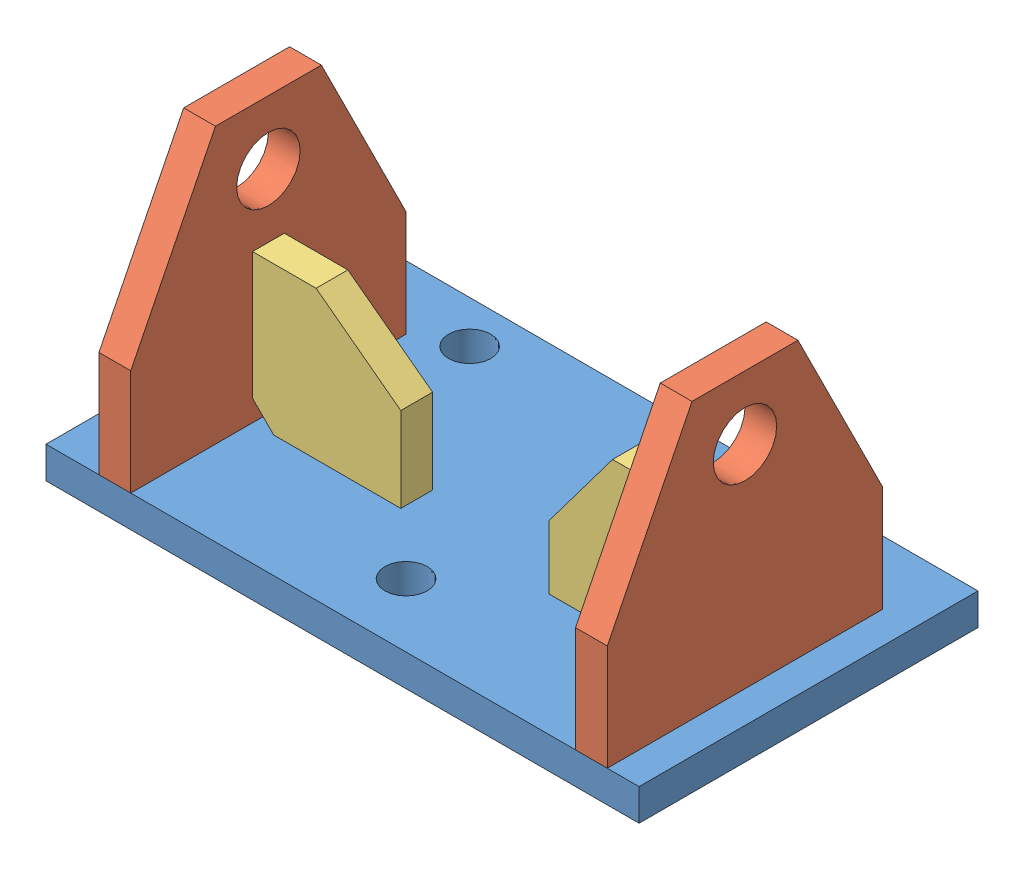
SolidWorks assembly Basic Mates Assembly_&.SLDASM, configuration Default (file format 3100). Lengths in mm.
Overall size (177.8 92.08 101.6).
5 component instances, 3 part files, 12 mates.
Components (placement in the parent):
- RectBase_&-1: RectBase_&.SLDPRT [Default] at origin size (177.8 9.53 101.6)
- EndConnect_&-1: EndConnect_&.SLDPRT [Default] at (-73.025 9.525 9.525) x (0 0 -1) z (1 0 0) size (82.55 82.55 9.53)
- EndConnect_&-2: EndConnect_&.SLDPRT [Default] at (69.85 9.525 9.525) x (0 0 -1) z (1 0 0) size (82.55 82.55 9.53)
- Brace_&-1: Brace_&.SLDPRT [Default] at (-63.5 9.525 9.525) x (1 0 0) z (0 -1 0) size (44.45 9.53 44.45)
- Brace_&-2: Brace_&.SLDPRT [Default] at (69.85 9.525 9.525) x (0 1 0) z (1 0 0) size (44.45 9.53 44.45)
Mates (geometry in assembly coordinates):
- Distance1: distance = 9.525 mm aligned: plane of RectBase_&-1; plane of EndConnect_&-2
- Coincident2: coincident anti-aligned: plane of RectBase_&-1; plane of EndConnect_&-2
- Coincident3: coincident aligned: plane of RectBase_&-1; plane of EndConnect_&-2
- Coincident4: coincident anti-aligned: plane of RectBase_&-1; plane of EndConnect_&-1
- Distance2: distance = 133.35 mm anti-aligned: plane of EndConnect_&-1; plane of EndConnect_&-2
- Coincident6: coincident aligned: plane of RectBase_&-1; plane of EndConnect_&-1
- Coincident7: coincident anti-aligned: plane of RectBase_&-1; plane of Brace_&-1
- Coincident8: coincident anti-aligned: plane of EndConnect_&-1; plane of Brace_&-1
- Coincident9: coincident anti-aligned: plane of EndConnect_&-2; plane of Brace_&-2
- Coincident10: coincident anti-aligned: plane of RectBase_&-1; plane of Brace_&-2
- Coincident11: coincident anti-aligned: plane of EndConnect_&-2; plane of Brace_&-1
- Coincident12: coincident aligned: plane of Brace_&-1; plane of Brace_&-2
